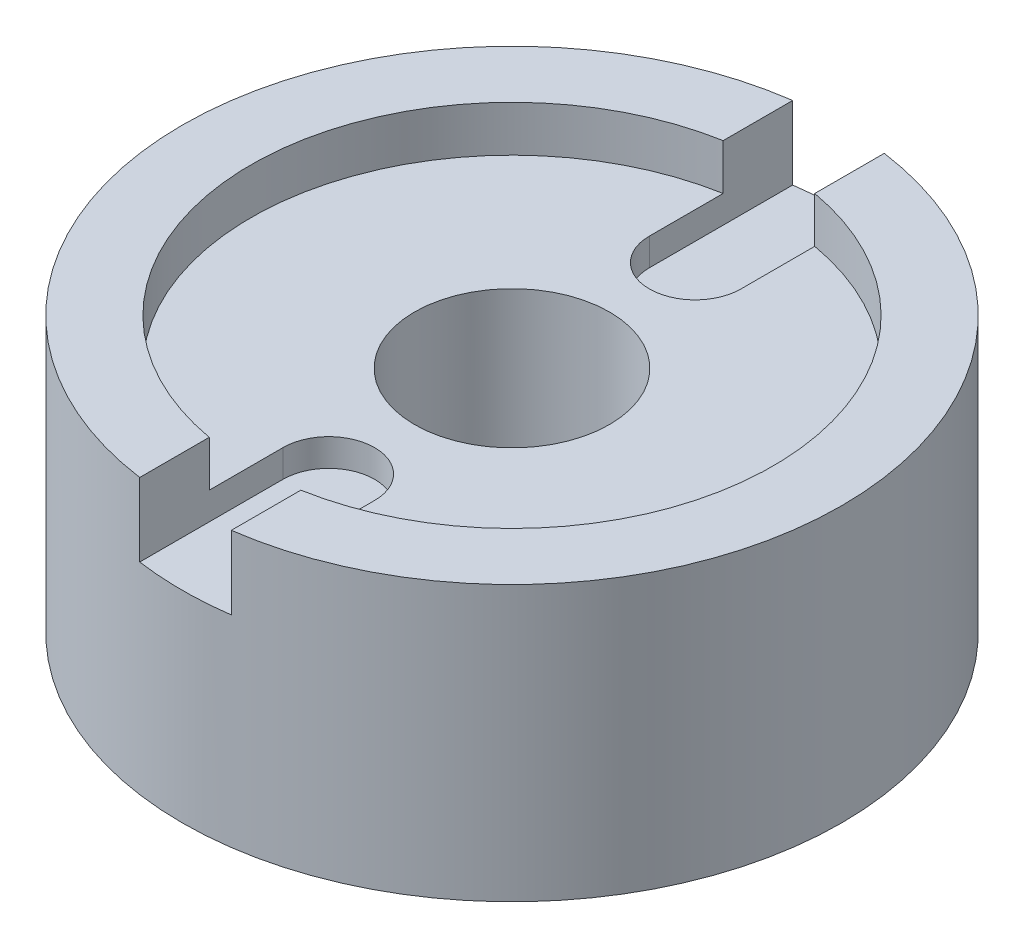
ISO-10303-21;
HEADER;
FILE_DESCRIPTION(('STEP AP214'),'2;1');
FILE_NAME('part.step','',(''),(''),'','','');
FILE_SCHEMA(('AUTOMOTIVE_DESIGN { 1 0 10303 214 1 1 1 1 }'));
ENDSEC;
DATA;
#1=APPLICATION_CONTEXT('core data for automotive mechanical design processes');
#2=APPLICATION_PROTOCOL_DEFINITION('international standard','automotive_design',2000,#1);
#3=PRODUCT_CONTEXT('',#1,'mechanical');
#4=PRODUCT('Part','Part','',(#3));
#5=PRODUCT_RELATED_PRODUCT_CATEGORY('part','',(#4));
#6=PRODUCT_DEFINITION_FORMATION('','',#4);
#7=PRODUCT_DEFINITION_CONTEXT('part definition',#1,'design');
#8=PRODUCT_DEFINITION('design','',#6,#7);
#9=PRODUCT_DEFINITION_SHAPE('','',#8);
#10=(LENGTH_UNIT() NAMED_UNIT(*) SI_UNIT(.MILLI.,.METRE.));
#11=(NAMED_UNIT(*) PLANE_ANGLE_UNIT() SI_UNIT($,.RADIAN.));
#12=(NAMED_UNIT(*) SI_UNIT($,.STERADIAN.) SOLID_ANGLE_UNIT());
#13=UNCERTAINTY_MEASURE_WITH_UNIT(LENGTH_MEASURE(1.E-05),#10,'distance_accuracy_value','');
#14=(GEOMETRIC_REPRESENTATION_CONTEXT(3) GLOBAL_UNCERTAINTY_ASSIGNED_CONTEXT((#13)) GLOBAL_UNIT_ASSIGNED_CONTEXT((#10,
#11,#12)) REPRESENTATION_CONTEXT('',''));
#15=CARTESIAN_POINT('',(0.,0.,0.));
#16=DIRECTION('',(0.,0.,1.));
#17=DIRECTION('',(1.,0.,0.));
#18=AXIS2_PLACEMENT_3D('',#15,#16,#17);
#19=CARTESIAN_POINT('',(0.,7.61999999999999,0.));
#20=DIRECTION('',(0.,-1.,0.));
#21=DIRECTION('',(0.,0.,-1.));
#22=AXIS2_PLACEMENT_3D('',#19,#20,#21);
#23=CYLINDRICAL_SURFACE('',#22,9.144);
#24=CARTESIAN_POINT('',(0.,0.,0.));
#25=DIRECTION('',(0.,1.,0.));
#26=DIRECTION('',(0.,0.,1.));
#27=AXIS2_PLACEMENT_3D('',#24,#25,#26);
#28=CIRCLE('',#27,9.144);
#29=CARTESIAN_POINT('',(0.,0.,9.144));
#30=VERTEX_POINT('',#29);
#31=EDGE_CURVE('E1377',#30,#30,#28,.T.);
#32=ORIENTED_EDGE('',*,*,#31,.T.);
#33=EDGE_LOOP('',(#32));
#34=FACE_BOUND('',#33,.T.);
#35=DIRECTION('',(0.,-1.,0.));
#36=VECTOR('',#35,1.);
#37=CARTESIAN_POINT('',(-1.27,7.62000000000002,-9.05537608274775));
#38=LINE('',#37,#36);
#39=CARTESIAN_POINT('',(-1.27,5.58800000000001,-9.05537608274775));
#40=VERTEX_POINT('',#39);
#41=CARTESIAN_POINT('',(-1.27,7.62000000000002,-9.05537608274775));
#42=VERTEX_POINT('',#41);
#43=EDGE_CURVE('E1334',#40,#42,#38,.F.);
#44=ORIENTED_EDGE('',*,*,#43,.F.);
#45=CARTESIAN_POINT('',(0.,5.58800000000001,0.));
#46=DIRECTION('',(0.,1.,0.));
#47=DIRECTION('',(0.,0.,1.));
#48=AXIS2_PLACEMENT_3D('',#45,#46,#47);
#49=CIRCLE('',#48,9.144);
#50=CARTESIAN_POINT('',(1.27,5.58800000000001,-9.05537608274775));
#51=VERTEX_POINT('',#50);
#52=EDGE_CURVE('E14',#51,#40,#49,.T.);
#53=ORIENTED_EDGE('',*,*,#52,.F.);
#54=DIRECTION('',(0.,-1.,0.));
#55=VECTOR('',#54,1.);
#56=CARTESIAN_POINT('',(1.27,7.62000000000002,-9.05537608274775));
#57=LINE('',#56,#55);
#58=CARTESIAN_POINT('',(1.27,7.62000000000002,-9.05537608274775));
#59=VERTEX_POINT('',#58);
#60=EDGE_CURVE('E1301',#59,#51,#57,.T.);
#61=ORIENTED_EDGE('',*,*,#60,.F.);
#62=CARTESIAN_POINT('',(0.,7.61999999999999,0.));
#63=DIRECTION('',(0.,1.,0.));
#64=DIRECTION('',(0.,0.,1.));
#65=AXIS2_PLACEMENT_3D('',#62,#63,#64);
#66=CIRCLE('',#65,9.144);
#67=CARTESIAN_POINT('',(1.27,7.61999999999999,9.05537608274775));
#68=VERTEX_POINT('',#67);
#69=EDGE_CURVE('E1381',#68,#59,#66,.T.);
#70=ORIENTED_EDGE('',*,*,#69,.F.);
#71=DIRECTION('',(0.,-1.,0.));
#72=VECTOR('',#71,1.);
#73=CARTESIAN_POINT('',(1.27,7.61999999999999,9.05537608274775));
#74=LINE('',#73,#72);
#75=CARTESIAN_POINT('',(1.27,5.58800000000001,9.05537608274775));
#76=VERTEX_POINT('',#75);
#77=EDGE_CURVE('E1362',#68,#76,#74,.T.);
#78=ORIENTED_EDGE('',*,*,#77,.T.);
#79=CARTESIAN_POINT('',(0.,5.58800000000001,0.));
#80=DIRECTION('',(0.,1.,0.));
#81=DIRECTION('',(0.,0.,1.));
#82=AXIS2_PLACEMENT_3D('',#79,#80,#81);
#83=CIRCLE('',#82,9.144);
#84=CARTESIAN_POINT('',(-1.27,5.58800000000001,9.05537608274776));
#85=VERTEX_POINT('',#84);
#86=EDGE_CURVE('E1392',#85,#76,#83,.T.);
#87=ORIENTED_EDGE('',*,*,#86,.F.);
#88=DIRECTION('',(0.,-1.,0.));
#89=VECTOR('',#88,1.);
#90=CARTESIAN_POINT('',(-1.27,7.61999999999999,9.05537608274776));
#91=LINE('',#90,#89);
#92=CARTESIAN_POINT('',(-1.27,7.61999999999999,9.05537608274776));
#93=VERTEX_POINT('',#92);
#94=EDGE_CURVE('E1356',#85,#93,#91,.F.);
#95=ORIENTED_EDGE('',*,*,#94,.T.);
#96=EDGE_CURVE('E1380',#42,#93,#66,.T.);
#97=ORIENTED_EDGE('',*,*,#96,.F.);
#98=EDGE_LOOP('',(#44,#53,#61,#70,#78,#87,#95,#97));
#99=FACE_BOUND('',#98,.T.);
#100=ADVANCED_FACE('F1212',(#34,#99),#23,.T.);
#101=CARTESIAN_POINT('',(0.,7.61999999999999,0.));
#102=DIRECTION('',(0.,1.,0.));
#103=DIRECTION('',(0.,0.,1.));
#104=AXIS2_PLACEMENT_3D('',#101,#102,#103);
#105=PLANE('',#104);
#106=CARTESIAN_POINT('',(0.,7.61999999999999,0.));
#107=DIRECTION('',(0.,1.,0.));
#108=DIRECTION('',(0.,0.,1.));
#109=AXIS2_PLACEMENT_3D('',#106,#107,#108);
#110=CIRCLE('',#109,7.239);
#111=CARTESIAN_POINT('',(-1.26999999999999,7.62000000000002,-7.12672582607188));
#112=VERTEX_POINT('',#111);
#113=CARTESIAN_POINT('',(-1.27,7.61999999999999,7.1267258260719));
#114=VERTEX_POINT('',#113);
#115=EDGE_CURVE('E1373',#112,#114,#110,.T.);
#116=ORIENTED_EDGE('',*,*,#115,.F.);
#117=DIRECTION('',(0.,0.,-1.));
#118=VECTOR('',#117,1.);
#119=CARTESIAN_POINT('',(-1.27,7.62000000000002,-5.08));
#120=LINE('',#119,#118);
#121=EDGE_CURVE('E1320',#112,#42,#120,.T.);
#122=ORIENTED_EDGE('',*,*,#121,.T.);
#123=ORIENTED_EDGE('',*,*,#96,.T.);
#124=DIRECTION('',(0.,0.,1.));
#125=VECTOR('',#124,1.);
#126=CARTESIAN_POINT('',(-1.27,7.61999999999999,5.08000000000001));
#127=LINE('',#126,#125);
#128=EDGE_CURVE('E1336',#114,#93,#127,.T.);
#129=ORIENTED_EDGE('',*,*,#128,.F.);
#130=EDGE_LOOP('',(#116,#122,#123,#129));
#131=FACE_BOUND('',#130,.T.);
#132=ADVANCED_FACE('F1410',(#131),#105,.T.);
#133=ORIENTED_EDGE('',*,*,#69,.T.);
#134=DIRECTION('',(0.,0.,1.));
#135=VECTOR('',#134,1.);
#136=CARTESIAN_POINT('',(1.27,7.62000000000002,-5.08));
#137=LINE('',#136,#135);
#138=CARTESIAN_POINT('',(1.27,7.62000000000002,-7.12672582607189));
#139=VERTEX_POINT('',#138);
#140=EDGE_CURVE('E1323',#59,#139,#137,.T.);
#141=ORIENTED_EDGE('',*,*,#140,.T.);
#142=CARTESIAN_POINT('',(1.27,7.61999999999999,7.1267258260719));
#143=VERTEX_POINT('',#142);
#144=EDGE_CURVE('E1369',#143,#139,#110,.T.);
#145=ORIENTED_EDGE('',*,*,#144,.F.);
#146=DIRECTION('',(0.,0.,-1.));
#147=VECTOR('',#146,1.);
#148=CARTESIAN_POINT('',(1.27,7.61999999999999,5.08000000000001));
#149=LINE('',#148,#147);
#150=EDGE_CURVE('E1339',#68,#143,#149,.T.);
#151=ORIENTED_EDGE('',*,*,#150,.F.);
#152=EDGE_LOOP('',(#133,#141,#145,#151));
#153=FACE_BOUND('',#152,.T.);
#154=ADVANCED_FACE('F1432',(#153),#105,.T.);
#155=CARTESIAN_POINT('',(0.,6.34999999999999,0.));
#156=DIRECTION('',(0.,1.,0.));
#157=DIRECTION('',(0.,0.,1.));
#158=AXIS2_PLACEMENT_3D('',#155,#156,#157);
#159=CYLINDRICAL_SURFACE('',#158,7.239);
#160=DIRECTION('',(0.,1.,0.));
#161=VECTOR('',#160,1.);
#162=CARTESIAN_POINT('',(-1.26999999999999,6.34999999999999,-7.12672582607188));
#163=LINE('',#162,#161);
#164=CARTESIAN_POINT('',(-1.26999999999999,6.34999999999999,-7.12672582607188));
#165=VERTEX_POINT('',#164);
#166=EDGE_CURVE('E1332',#112,#165,#163,.F.);
#167=ORIENTED_EDGE('',*,*,#166,.F.);
#168=ORIENTED_EDGE('',*,*,#115,.T.);
#169=DIRECTION('',(0.,1.,0.));
#170=VECTOR('',#169,1.);
#171=CARTESIAN_POINT('',(-1.27,6.34999999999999,7.1267258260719));
#172=LINE('',#171,#170);
#173=CARTESIAN_POINT('',(-1.27,6.34999999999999,7.1267258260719));
#174=VERTEX_POINT('',#173);
#175=EDGE_CURVE('E1352',#114,#174,#172,.F.);
#176=ORIENTED_EDGE('',*,*,#175,.T.);
#177=CARTESIAN_POINT('',(0.,6.34999999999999,0.));
#178=DIRECTION('',(0.,1.,0.));
#179=DIRECTION('',(0.,0.,1.));
#180=AXIS2_PLACEMENT_3D('',#177,#178,#179);
#181=CIRCLE('',#180,7.239);
#182=EDGE_CURVE('E1372',#165,#174,#181,.T.);
#183=ORIENTED_EDGE('',*,*,#182,.F.);
#184=EDGE_LOOP('',(#167,#168,#176,#183));
#185=FACE_BOUND('',#184,.T.);
#186=ADVANCED_FACE('F1404',(#185),#159,.F.);
#187=DIRECTION('',(0.,1.,0.));
#188=VECTOR('',#187,1.);
#189=CARTESIAN_POINT('',(1.27000000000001,6.34999999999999,-7.12672582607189));
#190=LINE('',#189,#188);
#191=CARTESIAN_POINT('',(1.27000000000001,6.34999999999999,-7.12672582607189));
#192=VERTEX_POINT('',#191);
#193=EDGE_CURVE('E1328',#192,#139,#190,.T.);
#194=ORIENTED_EDGE('',*,*,#193,.F.);
#195=CARTESIAN_POINT('',(1.27,6.34999999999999,7.1267258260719));
#196=VERTEX_POINT('',#195);
#197=EDGE_CURVE('E1374',#196,#192,#181,.T.);
#198=ORIENTED_EDGE('',*,*,#197,.F.);
#199=DIRECTION('',(0.,1.,0.));
#200=VECTOR('',#199,1.);
#201=CARTESIAN_POINT('',(1.27,6.34999999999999,7.1267258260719));
#202=LINE('',#201,#200);
#203=EDGE_CURVE('E1359',#196,#143,#202,.T.);
#204=ORIENTED_EDGE('',*,*,#203,.T.);
#205=ORIENTED_EDGE('',*,*,#144,.T.);
#206=EDGE_LOOP('',(#194,#198,#204,#205));
#207=FACE_BOUND('',#206,.T.);
#208=ADVANCED_FACE('F1428',(#207),#159,.F.);
#209=CARTESIAN_POINT('',(0.,6.34999999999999,0.));
#210=DIRECTION('',(0.,1.,0.));
#211=DIRECTION('',(0.,0.,1.));
#212=AXIS2_PLACEMENT_3D('',#209,#210,#211);
#213=PLANE('',#212);
#214=CARTESIAN_POINT('',(0.,6.34999999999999,0.));
#215=DIRECTION('',(0.,1.,0.));
#216=DIRECTION('',(0.,0.,1.));
#217=AXIS2_PLACEMENT_3D('',#214,#215,#216);
#218=CIRCLE('',#217,2.70509999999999);
#219=CARTESIAN_POINT('',(0.,6.34999999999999,2.7051));
#220=VERTEX_POINT('',#219);
#221=EDGE_CURVE('E1368',#220,#220,#218,.T.);
#222=ORIENTED_EDGE('',*,*,#221,.F.);
#223=EDGE_LOOP('',(#222));
#224=FACE_BOUND('',#223,.T.);
#225=CARTESIAN_POINT('',(0.,6.34999999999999,-5.08));
#226=DIRECTION('',(0.,1.,0.));
#227=DIRECTION('',(0.,0.,1.));
#228=AXIS2_PLACEMENT_3D('',#225,#226,#227);
#229=CIRCLE('',#228,1.27);
#230=CARTESIAN_POINT('',(1.27000000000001,6.34999999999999,-5.08));
#231=VERTEX_POINT('',#230);
#232=CARTESIAN_POINT('',(-1.27,6.34999999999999,-5.08));
#233=VERTEX_POINT('',#232);
#234=EDGE_CURVE('E1314',#231,#233,#229,.F.);
#235=ORIENTED_EDGE('',*,*,#234,.T.);
#236=DIRECTION('',(0.,0.,-1.));
#237=VECTOR('',#236,1.);
#238=CARTESIAN_POINT('',(-1.27,6.34999999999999,0.));
#239=LINE('',#238,#237);
#240=EDGE_CURVE('E1219',#233,#165,#239,.T.);
#241=ORIENTED_EDGE('',*,*,#240,.T.);
#242=ORIENTED_EDGE('',*,*,#182,.T.);
#243=DIRECTION('',(0.,0.,1.));
#244=VECTOR('',#243,1.);
#245=CARTESIAN_POINT('',(-1.27,6.34999999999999,0.));
#246=LINE('',#245,#244);
#247=CARTESIAN_POINT('',(-1.27,6.34999999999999,5.08000000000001));
#248=VERTEX_POINT('',#247);
#249=EDGE_CURVE('E1384',#248,#174,#246,.T.);
#250=ORIENTED_EDGE('',*,*,#249,.F.);
#251=CARTESIAN_POINT('',(0.,6.34999999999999,5.08000000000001));
#252=DIRECTION('',(0.,1.,0.));
#253=DIRECTION('',(0.,0.,1.));
#254=AXIS2_PLACEMENT_3D('',#251,#252,#253);
#255=CIRCLE('',#254,1.27);
#256=CARTESIAN_POINT('',(1.27,6.34999999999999,5.08000000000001));
#257=VERTEX_POINT('',#256);
#258=EDGE_CURVE('E1388',#257,#248,#255,.T.);
#259=ORIENTED_EDGE('',*,*,#258,.F.);
#260=DIRECTION('',(0.,0.,-1.));
#261=VECTOR('',#260,1.);
#262=CARTESIAN_POINT('',(1.27,6.34999999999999,0.));
#263=LINE('',#262,#261);
#264=EDGE_CURVE('E1390',#196,#257,#263,.T.);
#265=ORIENTED_EDGE('',*,*,#264,.F.);
#266=ORIENTED_EDGE('',*,*,#197,.T.);
#267=DIRECTION('',(0.,0.,1.));
#268=VECTOR('',#267,1.);
#269=CARTESIAN_POINT('',(1.27,6.34999999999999,0.));
#270=LINE('',#269,#268);
#271=EDGE_CURVE('E1394',#192,#231,#270,.T.);
#272=ORIENTED_EDGE('',*,*,#271,.T.);
#273=EDGE_LOOP('',(#235,#241,#242,#250,#259,#265,#266,#272));
#274=FACE_BOUND('',#273,.T.);
#275=ADVANCED_FACE('F1399',(#224,#274),#213,.T.);
#276=CARTESIAN_POINT('',(0.,0.,0.));
#277=DIRECTION('',(0.,1.,0.));
#278=DIRECTION('',(0.,0.,1.));
#279=AXIS2_PLACEMENT_3D('',#276,#277,#278);
#280=PLANE('',#279);
#281=CARTESIAN_POINT('',(0.,0.,0.));
#282=DIRECTION('',(0.,-1.,0.));
#283=DIRECTION('',(0.,0.,-1.));
#284=AXIS2_PLACEMENT_3D('',#281,#282,#283);
#285=CIRCLE('',#284,2.70509999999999);
#286=CARTESIAN_POINT('',(0.,0.,-2.70509999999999));
#287=VERTEX_POINT('',#286);
#288=EDGE_CURVE('E1365',#287,#287,#285,.T.);
#289=ORIENTED_EDGE('',*,*,#288,.F.);
#290=EDGE_LOOP('',(#289));
#291=FACE_BOUND('',#290,.T.);
#292=ORIENTED_EDGE('',*,*,#31,.F.);
#293=EDGE_LOOP('',(#292));
#294=FACE_BOUND('',#293,.T.);
#295=ADVANCED_FACE('F1451',(#291,#294),#280,.F.);
#296=CARTESIAN_POINT('',(0.,0.,0.));
#297=DIRECTION('',(0.,-1.,0.));
#298=DIRECTION('',(0.,0.,-1.));
#299=AXIS2_PLACEMENT_3D('',#296,#297,#298);
#300=CYLINDRICAL_SURFACE('',#299,2.70509999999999);
#301=ORIENTED_EDGE('',*,*,#221,.T.);
#302=EDGE_LOOP('',(#301));
#303=FACE_BOUND('',#302,.T.);
#304=ORIENTED_EDGE('',*,*,#288,.T.);
#305=EDGE_LOOP('',(#304));
#306=FACE_BOUND('',#305,.T.);
#307=ADVANCED_FACE('F1453',(#303,#306),#300,.F.);
#308=CARTESIAN_POINT('',(0.,5.58800000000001,5.08000000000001));
#309=DIRECTION('',(0.,1.,0.));
#310=DIRECTION('',(0.,0.,1.));
#311=AXIS2_PLACEMENT_3D('',#308,#309,#310);
#312=PLANE('',#311);
#313=ORIENTED_EDGE('',*,*,#86,.T.);
#314=DIRECTION('',(0.,0.,-1.));
#315=VECTOR('',#314,1.);
#316=CARTESIAN_POINT('',(1.27,5.58800000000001,5.08000000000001));
#317=LINE('',#316,#315);
#318=CARTESIAN_POINT('',(1.27,5.58800000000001,5.08000000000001));
#319=VERTEX_POINT('',#318);
#320=EDGE_CURVE('E1347',#76,#319,#317,.T.);
#321=ORIENTED_EDGE('',*,*,#320,.T.);
#322=CARTESIAN_POINT('',(0.,5.58800000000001,5.08000000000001));
#323=DIRECTION('',(0.,1.,0.));
#324=DIRECTION('',(0.,0.,1.));
#325=AXIS2_PLACEMENT_3D('',#322,#323,#324);
#326=CIRCLE('',#325,1.27);
#327=CARTESIAN_POINT('',(-1.27,5.58800000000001,5.08000000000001));
#328=VERTEX_POINT('',#327);
#329=EDGE_CURVE('E1341',#319,#328,#326,.T.);
#330=ORIENTED_EDGE('',*,*,#329,.T.);
#331=DIRECTION('',(0.,0.,1.));
#332=VECTOR('',#331,1.);
#333=CARTESIAN_POINT('',(-1.27,5.58800000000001,5.08000000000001));
#334=LINE('',#333,#332);
#335=EDGE_CURVE('E1344',#328,#85,#334,.T.);
#336=ORIENTED_EDGE('',*,*,#335,.T.);
#337=EDGE_LOOP('',(#313,#321,#330,#336));
#338=FACE_BOUND('',#337,.T.);
#339=ADVANCED_FACE('F1416',(#338),#312,.T.);
#340=CARTESIAN_POINT('',(1.27,5.58800000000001,5.08000000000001));
#341=DIRECTION('',(0.999999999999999,0.,0.));
#342=DIRECTION('',(0.,0.,-1.));
#343=AXIS2_PLACEMENT_3D('',#340,#341,#342);
#344=PLANE('',#343);
#345=ORIENTED_EDGE('',*,*,#150,.T.);
#346=ORIENTED_EDGE('',*,*,#203,.F.);
#347=ORIENTED_EDGE('',*,*,#264,.T.);
#348=DIRECTION('',(0.,1.,0.));
#349=VECTOR('',#348,1.);
#350=CARTESIAN_POINT('',(1.27,5.58800000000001,5.08000000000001));
#351=LINE('',#350,#349);
#352=EDGE_CURVE('E1349',#319,#257,#351,.T.);
#353=ORIENTED_EDGE('',*,*,#352,.F.);
#354=ORIENTED_EDGE('',*,*,#320,.F.);
#355=ORIENTED_EDGE('',*,*,#77,.F.);
#356=EDGE_LOOP('',(#345,#346,#347,#353,#354,#355));
#357=FACE_BOUND('',#356,.T.);
#358=ADVANCED_FACE('F1472',(#357),#344,.F.);
#359=CARTESIAN_POINT('',(-1.27,5.58800000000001,5.08000000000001));
#360=DIRECTION('',(-0.999999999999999,0.,0.));
#361=DIRECTION('',(0.,0.,1.));
#362=AXIS2_PLACEMENT_3D('',#359,#360,#361);
#363=PLANE('',#362);
#364=ORIENTED_EDGE('',*,*,#335,.F.);
#365=DIRECTION('',(0.,1.,0.));
#366=VECTOR('',#365,1.);
#367=CARTESIAN_POINT('',(-1.27,5.58800000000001,5.08000000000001));
#368=LINE('',#367,#366);
#369=EDGE_CURVE('E1234',#328,#248,#368,.T.);
#370=ORIENTED_EDGE('',*,*,#369,.T.);
#371=ORIENTED_EDGE('',*,*,#249,.T.);
#372=ORIENTED_EDGE('',*,*,#175,.F.);
#373=ORIENTED_EDGE('',*,*,#128,.T.);
#374=ORIENTED_EDGE('',*,*,#94,.F.);
#375=EDGE_LOOP('',(#364,#370,#371,#372,#373,#374));
#376=FACE_BOUND('',#375,.T.);
#377=ADVANCED_FACE('F1408',(#376),#363,.F.);
#378=CARTESIAN_POINT('',(0.,5.58800000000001,5.08000000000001));
#379=DIRECTION('',(0.,1.,0.));
#380=DIRECTION('',(0.,0.,1.));
#381=AXIS2_PLACEMENT_3D('',#378,#379,#380);
#382=CYLINDRICAL_SURFACE('',#381,1.27);
#383=ORIENTED_EDGE('',*,*,#258,.T.);
#384=ORIENTED_EDGE('',*,*,#369,.F.);
#385=ORIENTED_EDGE('',*,*,#329,.F.);
#386=ORIENTED_EDGE('',*,*,#352,.T.);
#387=EDGE_LOOP('',(#383,#384,#385,#386));
#388=FACE_BOUND('',#387,.T.);
#389=ADVANCED_FACE('F1421',(#388),#382,.F.);
#390=CARTESIAN_POINT('',(0.,5.58800000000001,-5.08));
#391=DIRECTION('',(0.,1.,0.));
#392=DIRECTION('',(0.,0.,-1.));
#393=AXIS2_PLACEMENT_3D('',#390,#391,#392);
#394=PLANE('',#393);
#395=ORIENTED_EDGE('',*,*,#52,.T.);
#396=DIRECTION('',(0.,0.,-1.));
#397=VECTOR('',#396,1.);
#398=CARTESIAN_POINT('',(-1.27,5.58800000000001,-5.08));
#399=LINE('',#398,#397);
#400=CARTESIAN_POINT('',(-1.27,5.58800000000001,-5.08));
#401=VERTEX_POINT('',#400);
#402=EDGE_CURVE('E1305',#401,#40,#399,.T.);
#403=ORIENTED_EDGE('',*,*,#402,.F.);
#404=CARTESIAN_POINT('',(0.,5.58800000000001,-5.08));
#405=DIRECTION('',(0.,-1.,0.));
#406=DIRECTION('',(0.,0.,-1.));
#407=AXIS2_PLACEMENT_3D('',#404,#405,#406);
#408=CIRCLE('',#407,1.27);
#409=CARTESIAN_POINT('',(1.27000000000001,5.58800000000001,-5.08));
#410=VERTEX_POINT('',#409);
#411=EDGE_CURVE('E1306',#410,#401,#408,.T.);
#412=ORIENTED_EDGE('',*,*,#411,.F.);
#413=DIRECTION('',(0.,0.,1.));
#414=VECTOR('',#413,1.);
#415=CARTESIAN_POINT('',(1.27000000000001,5.58800000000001,-5.08));
#416=LINE('',#415,#414);
#417=EDGE_CURVE('E1298',#51,#410,#416,.T.);
#418=ORIENTED_EDGE('',*,*,#417,.F.);
#419=EDGE_LOOP('',(#395,#403,#412,#418));
#420=FACE_BOUND('',#419,.T.);
#421=ADVANCED_FACE('F1318',(#420),#394,.T.);
#422=CARTESIAN_POINT('',(-1.27,5.58800000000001,-5.08));
#423=DIRECTION('',(0.999999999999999,0.,0.));
#424=DIRECTION('',(0.,0.,-1.));
#425=AXIS2_PLACEMENT_3D('',#422,#423,#424);
#426=PLANE('',#425);
#427=ORIENTED_EDGE('',*,*,#43,.T.);
#428=ORIENTED_EDGE('',*,*,#121,.F.);
#429=ORIENTED_EDGE('',*,*,#166,.T.);
#430=ORIENTED_EDGE('',*,*,#240,.F.);
#431=DIRECTION('',(0.,1.,0.));
#432=VECTOR('',#431,1.);
#433=CARTESIAN_POINT('',(-1.27,5.58800000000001,-5.08));
#434=LINE('',#433,#432);
#435=EDGE_CURVE('E1316',#401,#233,#434,.T.);
#436=ORIENTED_EDGE('',*,*,#435,.F.);
#437=ORIENTED_EDGE('',*,*,#402,.T.);
#438=EDGE_LOOP('',(#427,#428,#429,#430,#436,#437));
#439=FACE_BOUND('',#438,.T.);
#440=ADVANCED_FACE('F1435',(#439),#426,.T.);
#441=CARTESIAN_POINT('',(1.27000000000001,5.58800000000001,-5.08));
#442=DIRECTION('',(-0.999999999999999,0.,0.));
#443=DIRECTION('',(0.,0.,1.));
#444=AXIS2_PLACEMENT_3D('',#441,#442,#443);
#445=PLANE('',#444);
#446=ORIENTED_EDGE('',*,*,#60,.T.);
#447=ORIENTED_EDGE('',*,*,#417,.T.);
#448=DIRECTION('',(0.,1.,0.));
#449=VECTOR('',#448,1.);
#450=CARTESIAN_POINT('',(1.27000000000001,5.58800000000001,-5.08));
#451=LINE('',#450,#449);
#452=EDGE_CURVE('E1226',#410,#231,#451,.T.);
#453=ORIENTED_EDGE('',*,*,#452,.T.);
#454=ORIENTED_EDGE('',*,*,#271,.F.);
#455=ORIENTED_EDGE('',*,*,#193,.T.);
#456=ORIENTED_EDGE('',*,*,#140,.F.);
#457=EDGE_LOOP('',(#446,#447,#453,#454,#455,#456));
#458=FACE_BOUND('',#457,.T.);
#459=ADVANCED_FACE('F1299',(#458),#445,.T.);
#460=CARTESIAN_POINT('',(0.,5.58800000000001,-5.08));
#461=DIRECTION('',(0.,1.,0.));
#462=DIRECTION('',(0.,0.,1.));
#463=AXIS2_PLACEMENT_3D('',#460,#461,#462);
#464=CYLINDRICAL_SURFACE('',#463,1.27);
#465=ORIENTED_EDGE('',*,*,#452,.F.);
#466=ORIENTED_EDGE('',*,*,#411,.T.);
#467=ORIENTED_EDGE('',*,*,#435,.T.);
#468=ORIENTED_EDGE('',*,*,#234,.F.);
#469=EDGE_LOOP('',(#465,#466,#467,#468));
#470=FACE_BOUND('',#469,.T.);
#471=ADVANCED_FACE('F1310',(#470),#464,.F.);
#472=CLOSED_SHELL('',(#100,#132,#154,#186,#208,#275,#295,#307,#339,#358,#377,#389,#421,#440,
#459,#471));
#473=MANIFOLD_SOLID_BREP('B2',#472);
#474=ADVANCED_BREP_SHAPE_REPRESENTATION('',(#18,#473),#14);
#475=SHAPE_DEFINITION_REPRESENTATION(#9,#474);
ENDSEC;
END-ISO-10303-21;
